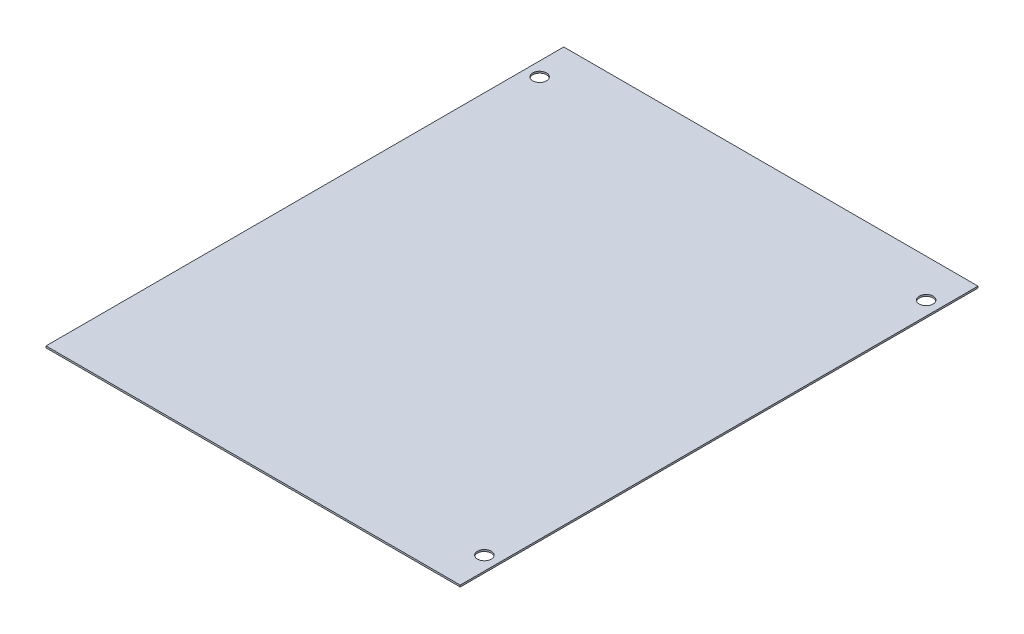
from build123d import *

# Parameters (mm, degrees)
SKETCH1_W           = 1524
SKETCH1_H           = 1905
BOSS_EXTRUDE1_DEPTH = 6.35
SKETCH3_R           = 25.4
CUT_EXTRUDE1_DEPTH  = 25.4


with BuildPart() as part:
    # Sketch1 → Boss-Extrude1 (new body)
    with BuildSketch(Plane(origin=(0, 0, 0), x_dir=(1, 0, 0), z_dir=(0, 1, 0))):
        with Locations((687.831261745, 896.803901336)):
            Rectangle(SKETCH1_W, SKETCH1_H)
    extrude(amount=BOSS_EXTRUDE1_DEPTH)

    # Sketch3 → Cut-Extrude1 (cut)
    with BuildSketch(Plane(origin=(0, 6.35, 0), x_dir=(-1, 0, 0), z_dir=(0, 1, 0))):
        with Locations(Location((23.368738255, -1709.603901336, 0), (0, 0, 90))):
            Circle(SKETCH3_R)
        with Locations(Location((-1399.031261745, -84.003901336, 0), (0, 0, 90))):
            Circle(SKETCH3_R)
        with Locations(Location((-1399.031261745, -1709.603901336, 0), (0, 0, 90))):
            Circle(SKETCH3_R)
    extrude(amount=-CUT_EXTRUDE1_DEPTH, mode=Mode.SUBTRACT)


solid = part.part
